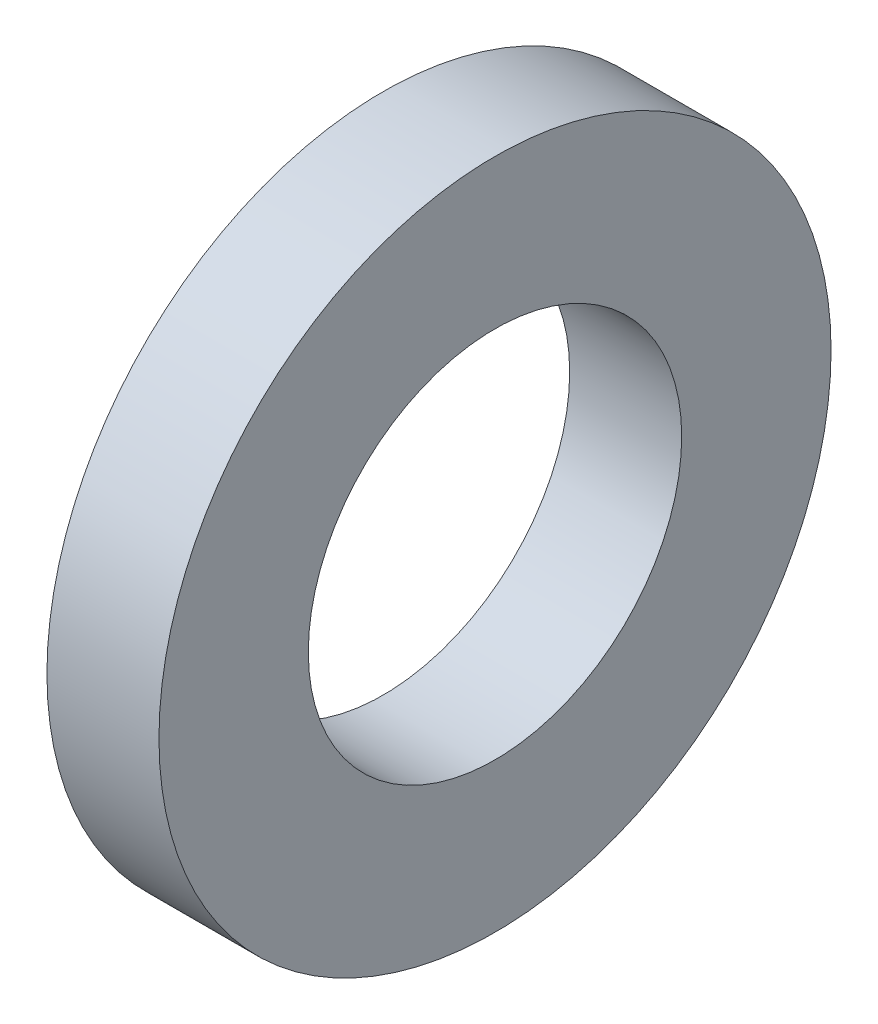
from build123d import *

# Parameters (mm, degrees)
ESQUISSE1_R          = 9
ESQUISSE1_R_2        = 5
BASE_EXTRUSION_DEPTH = 3


with BuildPart() as part:
    # Esquisse1 → Base-Extrusion (new body)
    with BuildSketch(Plane(origin=(0, 0, 0), x_dir=(0, 0, -1), z_dir=(1, 0, 0))):
        Circle(ESQUISSE1_R)
        Circle(ESQUISSE1_R_2, mode=Mode.SUBTRACT)
    extrude(amount=BASE_EXTRUSION_DEPTH)


solid = part.part
